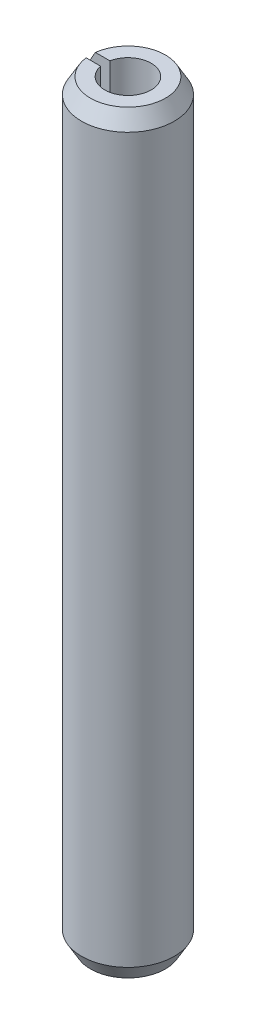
ISO-10303-21;
HEADER;
FILE_DESCRIPTION(('STEP AP214'),'2;1');
FILE_NAME('part.step','',(''),(''),'','','');
FILE_SCHEMA(('AUTOMOTIVE_DESIGN { 1 0 10303 214 1 1 1 1 }'));
ENDSEC;
DATA;
#1=APPLICATION_CONTEXT('core data for automotive mechanical design processes');
#2=APPLICATION_PROTOCOL_DEFINITION('international standard','automotive_design',2000,#1);
#3=PRODUCT_CONTEXT('',#1,'mechanical');
#4=PRODUCT('Part','Part','',(#3));
#5=PRODUCT_RELATED_PRODUCT_CATEGORY('part','',(#4));
#6=PRODUCT_DEFINITION_FORMATION('','',#4);
#7=PRODUCT_DEFINITION_CONTEXT('part definition',#1,'design');
#8=PRODUCT_DEFINITION('design','',#6,#7);
#9=PRODUCT_DEFINITION_SHAPE('','',#8);
#10=(LENGTH_UNIT() NAMED_UNIT(*) SI_UNIT(.MILLI.,.METRE.));
#11=(NAMED_UNIT(*) PLANE_ANGLE_UNIT() SI_UNIT($,.RADIAN.));
#12=(NAMED_UNIT(*) SI_UNIT($,.STERADIAN.) SOLID_ANGLE_UNIT());
#13=UNCERTAINTY_MEASURE_WITH_UNIT(LENGTH_MEASURE(1.E-05),#10,'distance_accuracy_value','');
#14=(GEOMETRIC_REPRESENTATION_CONTEXT(3) GLOBAL_UNCERTAINTY_ASSIGNED_CONTEXT((#13)) GLOBAL_UNIT_ASSIGNED_CONTEXT((#10,
#11,#12)) REPRESENTATION_CONTEXT('',''));
#15=CARTESIAN_POINT('',(0.,0.,0.));
#16=DIRECTION('',(0.,0.,1.));
#17=DIRECTION('',(1.,0.,0.));
#18=AXIS2_PLACEMENT_3D('',#15,#16,#17);
#19=CARTESIAN_POINT('',(2.,32.5,0.));
#20=DIRECTION('',(0.,-1.,0.));
#21=DIRECTION('',(0.,0.,-1.));
#22=AXIS2_PLACEMENT_3D('',#19,#20,#21);
#23=PLANE('',#22);
#24=CARTESIAN_POINT('',(0.,32.5,0.));
#25=DIRECTION('',(0.,-1.,0.));
#26=DIRECTION('',(0.,0.,-1.));
#27=AXIS2_PLACEMENT_3D('',#24,#25,#26);
#28=CIRCLE('',#27,3.23019964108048);
#29=CARTESIAN_POINT('',(-3.20533769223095,32.5,0.4));
#30=VERTEX_POINT('',#29);
#31=CARTESIAN_POINT('',(-3.20533769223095,32.5,-0.4));
#32=VERTEX_POINT('',#31);
#33=EDGE_CURVE('E102',#30,#32,#28,.F.);
#34=ORIENTED_EDGE('',*,*,#33,.T.);
#35=DIRECTION('',(-1.,0.,0.));
#36=VECTOR('',#35,1.);
#37=CARTESIAN_POINT('',(0.,32.5,-0.4));
#38=LINE('',#37,#36);
#39=CARTESIAN_POINT('',(-1.95959179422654,32.5,-0.4));
#40=VERTEX_POINT('',#39);
#41=EDGE_CURVE('E50',#40,#32,#38,.T.);
#42=ORIENTED_EDGE('',*,*,#41,.F.);
#43=CARTESIAN_POINT('',(0.,32.5,0.));
#44=DIRECTION('',(0.,1.,0.));
#45=DIRECTION('',(0.,0.,1.));
#46=AXIS2_PLACEMENT_3D('',#43,#44,#45);
#47=CIRCLE('',#46,2.);
#48=CARTESIAN_POINT('',(-1.95959179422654,32.5,0.4));
#49=VERTEX_POINT('',#48);
#50=EDGE_CURVE('E94',#49,#40,#47,.T.);
#51=ORIENTED_EDGE('',*,*,#50,.F.);
#52=DIRECTION('',(1.,0.,0.));
#53=VECTOR('',#52,1.);
#54=CARTESIAN_POINT('',(0.,32.5,0.4));
#55=LINE('',#54,#53);
#56=EDGE_CURVE('E103',#30,#49,#55,.T.);
#57=ORIENTED_EDGE('',*,*,#56,.F.);
#58=EDGE_LOOP('',(#34,#42,#51,#57));
#59=FACE_BOUND('',#58,.T.);
#60=ADVANCED_FACE('F31',(#59),#23,.F.);
#61=CARTESIAN_POINT('',(0.,32.5,0.));
#62=DIRECTION('',(0.,1.,0.));
#63=DIRECTION('',(0.,0.,1.));
#64=AXIS2_PLACEMENT_3D('',#61,#62,#63);
#65=CYLINDRICAL_SURFACE('',#64,4.);
#66=CARTESIAN_POINT('',(0.,-31.1666666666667,0.));
#67=DIRECTION('',(0.,1.,0.));
#68=DIRECTION('',(0.,0.,1.));
#69=AXIS2_PLACEMENT_3D('',#66,#67,#68);
#70=CIRCLE('',#69,4.);
#71=CARTESIAN_POINT('',(-3.97994974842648,-31.1666666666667,0.4));
#72=VERTEX_POINT('',#71);
#73=CARTESIAN_POINT('',(-3.97994974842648,-31.1666666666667,-0.4));
#74=VERTEX_POINT('',#73);
#75=EDGE_CURVE('E116',#72,#74,#70,.T.);
#76=ORIENTED_EDGE('',*,*,#75,.T.);
#77=DIRECTION('',(0.,1.,0.));
#78=VECTOR('',#77,1.);
#79=CARTESIAN_POINT('',(-3.97994974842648,32.5,-0.4));
#80=LINE('',#79,#78);
#81=CARTESIAN_POINT('',(-3.97994974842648,31.1666666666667,-0.4));
#82=VERTEX_POINT('',#81);
#83=EDGE_CURVE('E151',#74,#82,#80,.T.);
#84=ORIENTED_EDGE('',*,*,#83,.T.);
#85=CARTESIAN_POINT('',(0.,31.1666666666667,0.));
#86=DIRECTION('',(0.,-1.,0.));
#87=DIRECTION('',(0.,0.,-1.));
#88=AXIS2_PLACEMENT_3D('',#85,#86,#87);
#89=CIRCLE('',#88,4.);
#90=CARTESIAN_POINT('',(-3.97994974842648,31.1666666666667,0.4));
#91=VERTEX_POINT('',#90);
#92=EDGE_CURVE('E110',#82,#91,#89,.T.);
#93=ORIENTED_EDGE('',*,*,#92,.T.);
#94=DIRECTION('',(0.,1.,0.));
#95=VECTOR('',#94,1.);
#96=CARTESIAN_POINT('',(-3.97994974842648,32.5,0.4));
#97=LINE('',#96,#95);
#98=EDGE_CURVE('E58',#91,#72,#97,.F.);
#99=ORIENTED_EDGE('',*,*,#98,.T.);
#100=EDGE_LOOP('',(#76,#84,#93,#99));
#101=FACE_BOUND('',#100,.T.);
#102=ADVANCED_FACE('F155',(#101),#65,.T.);
#103=CARTESIAN_POINT('',(4.00000000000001,-32.5,0.));
#104=DIRECTION('',(0.,1.,0.));
#105=DIRECTION('',(0.,0.,1.));
#106=AXIS2_PLACEMENT_3D('',#103,#104,#105);
#107=PLANE('',#106);
#108=CARTESIAN_POINT('',(0.,-32.5,0.));
#109=DIRECTION('',(0.,1.,0.));
#110=DIRECTION('',(0.,0.,1.));
#111=AXIS2_PLACEMENT_3D('',#108,#109,#110);
#112=CIRCLE('',#111,2.);
#113=CARTESIAN_POINT('',(-1.95959179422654,-32.5,0.4));
#114=VERTEX_POINT('',#113);
#115=CARTESIAN_POINT('',(-1.95959179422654,-32.5,-0.4));
#116=VERTEX_POINT('',#115);
#117=EDGE_CURVE('E108',#114,#116,#112,.T.);
#118=ORIENTED_EDGE('',*,*,#117,.T.);
#119=DIRECTION('',(-1.,0.,0.));
#120=VECTOR('',#119,1.);
#121=CARTESIAN_POINT('',(0.,-32.5,-0.4));
#122=LINE('',#121,#120);
#123=CARTESIAN_POINT('',(-3.20533769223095,-32.5,-0.4));
#124=VERTEX_POINT('',#123);
#125=EDGE_CURVE('E89',#116,#124,#122,.T.);
#126=ORIENTED_EDGE('',*,*,#125,.T.);
#127=CARTESIAN_POINT('',(0.,-32.5,0.));
#128=DIRECTION('',(0.,1.,0.));
#129=DIRECTION('',(0.,0.,1.));
#130=AXIS2_PLACEMENT_3D('',#127,#128,#129);
#131=CIRCLE('',#130,3.23019964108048);
#132=CARTESIAN_POINT('',(-3.20533769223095,-32.5,0.4));
#133=VERTEX_POINT('',#132);
#134=EDGE_CURVE('E119',#124,#133,#131,.F.);
#135=ORIENTED_EDGE('',*,*,#134,.T.);
#136=DIRECTION('',(1.,0.,0.));
#137=VECTOR('',#136,1.);
#138=CARTESIAN_POINT('',(0.,-32.5,0.4));
#139=LINE('',#138,#137);
#140=EDGE_CURVE('E160',#133,#114,#139,.T.);
#141=ORIENTED_EDGE('',*,*,#140,.T.);
#142=EDGE_LOOP('',(#118,#126,#135,#141));
#143=FACE_BOUND('',#142,.T.);
#144=ADVANCED_FACE('F166',(#143),#107,.F.);
#145=CARTESIAN_POINT('',(0.,32.5,0.));
#146=DIRECTION('',(0.,1.,0.));
#147=DIRECTION('',(0.,0.,1.));
#148=AXIS2_PLACEMENT_3D('',#145,#146,#147);
#149=CYLINDRICAL_SURFACE('',#148,2.);
#150=ORIENTED_EDGE('',*,*,#50,.T.);
#151=DIRECTION('',(0.,1.,0.));
#152=VECTOR('',#151,1.);
#153=CARTESIAN_POINT('',(-1.95959179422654,32.5,-0.4));
#154=LINE('',#153,#152);
#155=EDGE_CURVE('E86',#40,#116,#154,.F.);
#156=ORIENTED_EDGE('',*,*,#155,.T.);
#157=ORIENTED_EDGE('',*,*,#117,.F.);
#158=DIRECTION('',(0.,1.,0.));
#159=VECTOR('',#158,1.);
#160=CARTESIAN_POINT('',(-1.95959179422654,32.5,0.4));
#161=LINE('',#160,#159);
#162=EDGE_CURVE('E107',#114,#49,#161,.T.);
#163=ORIENTED_EDGE('',*,*,#162,.T.);
#164=EDGE_LOOP('',(#150,#156,#157,#163));
#165=FACE_BOUND('',#164,.T.);
#166=ADVANCED_FACE('F106',(#165),#149,.F.);
#167=CARTESIAN_POINT('',(0.,-31.1666666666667,0.));
#168=DIRECTION('',(0.,1.,0.));
#169=DIRECTION('',(0.,0.,1.));
#170=AXIS2_PLACEMENT_3D('',#167,#168,#169);
#171=CONICAL_SURFACE('',#170,4.,0.523598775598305);
#172=CARTESIAN_POINT('',(-5.97070394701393,-27.7301259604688,-0.4));
#173=CARTESIAN_POINT('',(-5.77082052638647,-28.075554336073,-0.4));
#174=CARTESIAN_POINT('',(-5.57090805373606,-28.4209659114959,-0.4));
#175=CARTESIAN_POINT('',(-5.1709901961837,-29.1117340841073,-0.4));
#176=CARTESIAN_POINT('',(-4.9709848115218,-29.4570906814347,-0.4));
#177=CARTESIAN_POINT('',(-4.57084755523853,-30.1477253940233,-0.4));
#178=CARTESIAN_POINT('',(-4.37071568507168,-30.493003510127,-0.4));
#179=CARTESIAN_POINT('',(-3.970257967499,-31.1834484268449,-0.4));
#180=CARTESIAN_POINT('',(-3.76993211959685,-31.5286152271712,-0.4));
#181=CARTESIAN_POINT('',(-3.36897378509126,-32.2187802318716,-0.4));
#182=CARTESIAN_POINT('',(-3.16834129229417,-32.5637784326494,-0.4));
#183=CARTESIAN_POINT('',(-2.8669955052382,-33.0810428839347,-0.4));
#184=CARTESIAN_POINT('',(-2.76648107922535,-33.2534249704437,-0.4));
#185=CARTESIAN_POINT('',(-2.5652667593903,-33.5980813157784,-0.4));
#186=CARTESIAN_POINT('',(-2.46456686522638,-33.7703555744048,-0.4));
#187=CARTESIAN_POINT('',(-2.26290181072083,-34.1147541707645,-0.4));
#188=CARTESIAN_POINT('',(-2.16193664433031,-34.2868785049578,-0.4));
#189=CARTESIAN_POINT('',(-1.95961247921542,-34.6308944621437,-0.4));
#190=CARTESIAN_POINT('',(-1.85825348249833,-34.8027860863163,-0.4));
#191=CARTESIAN_POINT('',(-1.65490956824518,-35.1462050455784,-0.4));
#192=CARTESIAN_POINT('',(-1.55292463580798,-35.3177323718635,-0.4));
#193=CARTESIAN_POINT('',(-1.39912493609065,-35.5745334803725,-0.4));
#194=CARTESIAN_POINT('',(-1.34772087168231,-35.660052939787,-0.4));
#195=CARTESIAN_POINT('',(-1.24451429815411,-35.8308519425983,-0.4));
#196=CARTESIAN_POINT('',(-1.19271178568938,-35.9161314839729,-0.4));
#197=CARTESIAN_POINT('',(-1.1406481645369,-36.0012522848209,-0.4));
#198=B_SPLINE_CURVE_WITH_KNOTS('',3,(#172,#173,#174,#175,#176,#177,#178,#179,#180,#181,#182,
#183,#184,#185,#186,#187,#188,#189,#190,#191,#192,#193,#194,#195,#196,#197),.UNSPECIFIED.,.F.,
.F.,(4,2,2,2,2,2,2,2,2,2,2,2,4),(0.,1.19727495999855,2.39454684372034,3.59180520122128,
4.78906663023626,5.98635256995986,6.58499144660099,7.18363142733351,7.78228517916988,
8.38093588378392,8.97960089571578,9.27893857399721,9.57827876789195),.UNSPECIFIED.);
#199=EDGE_CURVE('E95',#74,#124,#198,.T.);
#200=ORIENTED_EDGE('',*,*,#199,.F.);
#201=ORIENTED_EDGE('',*,*,#75,.F.);
#202=CARTESIAN_POINT('',(-1.1406481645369,-36.0012522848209,0.4));
#203=CARTESIAN_POINT('',(-1.21071491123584,-35.8866570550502,0.4));
#204=CARTESIAN_POINT('',(-1.2803354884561,-35.7717912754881,0.4));
#205=CARTESIAN_POINT('',(-1.41892863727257,-35.5416712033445,0.4));
#206=CARTESIAN_POINT('',(-1.48790121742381,-35.4264169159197,0.4));
#207=CARTESIAN_POINT('',(-1.62544297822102,-35.1956720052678,0.4));
#208=CARTESIAN_POINT('',(-1.69401216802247,-35.0801813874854,0.4));
#209=CARTESIAN_POINT('',(-1.83086264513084,-34.849029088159,0.4));
#210=CARTESIAN_POINT('',(-1.89914393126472,-34.7333674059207,0.4));
#211=CARTESIAN_POINT('',(-2.10173269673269,-34.3895131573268,0.4));
#212=CARTESIAN_POINT('',(-2.23574693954,-34.1611479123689,0.4));
#213=CARTESIAN_POINT('',(-2.50332143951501,-33.7041515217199,0.4));
#214=CARTESIAN_POINT('',(-2.63688169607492,-33.4755203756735,0.4));
#215=CARTESIAN_POINT('',(-3.03714675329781,-32.7893713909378,0.4));
#216=CARTESIAN_POINT('',(-3.30343011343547,-32.3316077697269,0.4));
#217=CARTESIAN_POINT('',(-3.76993481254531,-31.5286045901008,0.4));
#218=CARTESIAN_POINT('',(-3.97026782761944,-31.1834298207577,0.4));
#219=CARTESIAN_POINT('',(-4.3707380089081,-30.4929666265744,0.4));
#220=CARTESIAN_POINT('',(-4.57087517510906,-30.1476782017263,0.4));
#221=CARTESIAN_POINT('',(-4.97101256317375,-29.4570423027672,0.4));
#222=CARTESIAN_POINT('',(-5.17101279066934,-29.1116948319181,0.4));
#223=CARTESIAN_POINT('',(-5.57091977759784,-28.4209458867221,0.4));
#224=CARTESIAN_POINT('',(-5.77082653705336,-28.0755444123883,0.4));
#225=CARTESIAN_POINT('',(-5.97070394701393,-27.7301259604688,0.4));
#226=B_SPLINE_CURVE_WITH_KNOTS('',3,(#202,#203,#204,#205,#206,#207,#208,#209,#210,#211,#212,
#213,#214,#215,#216,#217,#218,#219,#220,#221,#222,#223,#224,#225),.UNSPECIFIED.,.F.,.F.,(4,2,2,
2,2,2,2,2,2,2,2,4),(0.,0.402951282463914,0.805897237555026,1.20883401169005,1.61177242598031,
2.40612299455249,3.2004746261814,4.78921185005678,5.98650482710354,7.18379788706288,
8.3810383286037,9.5782784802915),.UNSPECIFIED.);
#227=EDGE_CURVE('E133',#133,#72,#226,.T.);
#228=ORIENTED_EDGE('',*,*,#227,.F.);
#229=ORIENTED_EDGE('',*,*,#134,.F.);
#230=EDGE_LOOP('',(#200,#201,#228,#229));
#231=FACE_BOUND('',#230,.T.);
#232=ADVANCED_FACE('F141',(#231),#171,.T.);
#233=CARTESIAN_POINT('',(0.,32.5,0.));
#234=DIRECTION('',(0.,-1.,0.));
#235=DIRECTION('',(0.,0.,-1.));
#236=AXIS2_PLACEMENT_3D('',#233,#234,#235);
#237=CONICAL_SURFACE('',#236,3.23019964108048,0.523598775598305);
#238=CARTESIAN_POINT('',(-1.1406481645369,36.0012522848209,-0.4));
#239=CARTESIAN_POINT('',(-1.21071491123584,35.8866570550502,-0.4));
#240=CARTESIAN_POINT('',(-1.2803354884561,35.7717912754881,-0.4));
#241=CARTESIAN_POINT('',(-1.41892863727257,35.5416712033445,-0.4));
#242=CARTESIAN_POINT('',(-1.48790121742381,35.4264169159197,-0.4));
#243=CARTESIAN_POINT('',(-1.62544297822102,35.1956720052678,-0.4));
#244=CARTESIAN_POINT('',(-1.69401216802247,35.0801813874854,-0.4));
#245=CARTESIAN_POINT('',(-1.83086264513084,34.849029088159,-0.4));
#246=CARTESIAN_POINT('',(-1.89914393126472,34.7333674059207,-0.4));
#247=CARTESIAN_POINT('',(-2.10173269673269,34.3895131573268,-0.4));
#248=CARTESIAN_POINT('',(-2.23574693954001,34.1611479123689,-0.4));
#249=CARTESIAN_POINT('',(-2.50332143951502,33.7041515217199,-0.4));
#250=CARTESIAN_POINT('',(-2.63688169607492,33.4755203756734,-0.4));
#251=CARTESIAN_POINT('',(-3.03714675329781,32.7893713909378,-0.4));
#252=CARTESIAN_POINT('',(-3.30343011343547,32.3316077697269,-0.4));
#253=CARTESIAN_POINT('',(-3.76993481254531,31.5286045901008,-0.4));
#254=CARTESIAN_POINT('',(-3.97026782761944,31.1834298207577,-0.4));
#255=CARTESIAN_POINT('',(-4.3707380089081,30.4929666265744,-0.4));
#256=CARTESIAN_POINT('',(-4.57087517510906,30.1476782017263,-0.4));
#257=CARTESIAN_POINT('',(-4.97101256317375,29.4570423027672,-0.4));
#258=CARTESIAN_POINT('',(-5.17101279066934,29.1116948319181,-0.4));
#259=CARTESIAN_POINT('',(-5.57091977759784,28.4209458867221,-0.4));
#260=CARTESIAN_POINT('',(-5.77082653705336,28.0755444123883,-0.4));
#261=CARTESIAN_POINT('',(-5.97070394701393,27.7301259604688,-0.4));
#262=B_SPLINE_CURVE_WITH_KNOTS('',3,(#238,#239,#240,#241,#242,#243,#244,#245,#246,#247,#248,
#249,#250,#251,#252,#253,#254,#255,#256,#257,#258,#259,#260,#261),.UNSPECIFIED.,.F.,.F.,(4,2,2,
2,2,2,2,2,2,2,2,4),(0.,0.402951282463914,0.805897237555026,1.20883401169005,1.61177242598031,
2.40612299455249,3.20047462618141,4.78921185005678,5.98650482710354,7.18379788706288,
8.3810383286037,9.5782784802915),.UNSPECIFIED.);
#263=EDGE_CURVE('E11',#32,#82,#262,.T.);
#264=ORIENTED_EDGE('',*,*,#263,.F.);
#265=ORIENTED_EDGE('',*,*,#33,.F.);
#266=CARTESIAN_POINT('',(-5.97070394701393,27.7301259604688,0.4));
#267=CARTESIAN_POINT('',(-5.77082052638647,28.075554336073,0.4));
#268=CARTESIAN_POINT('',(-5.57090805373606,28.4209659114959,0.4));
#269=CARTESIAN_POINT('',(-5.1709901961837,29.1117340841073,0.4));
#270=CARTESIAN_POINT('',(-4.9709848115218,29.4570906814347,0.4));
#271=CARTESIAN_POINT('',(-4.57084755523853,30.1477253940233,0.4));
#272=CARTESIAN_POINT('',(-4.37071568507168,30.493003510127,0.4));
#273=CARTESIAN_POINT('',(-3.970257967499,31.1834484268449,0.4));
#274=CARTESIAN_POINT('',(-3.76993211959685,31.5286152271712,0.4));
#275=CARTESIAN_POINT('',(-3.36897378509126,32.2187802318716,0.4));
#276=CARTESIAN_POINT('',(-3.16834129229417,32.5637784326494,0.4));
#277=CARTESIAN_POINT('',(-2.8669955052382,33.0810428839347,0.4));
#278=CARTESIAN_POINT('',(-2.76648107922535,33.2534249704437,0.4));
#279=CARTESIAN_POINT('',(-2.5652667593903,33.5980813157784,0.4));
#280=CARTESIAN_POINT('',(-2.46456686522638,33.7703555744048,0.4));
#281=CARTESIAN_POINT('',(-2.26290181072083,34.1147541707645,0.4));
#282=CARTESIAN_POINT('',(-2.16193664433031,34.2868785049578,0.4));
#283=CARTESIAN_POINT('',(-1.95961247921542,34.6308944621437,0.4));
#284=CARTESIAN_POINT('',(-1.85825348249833,34.8027860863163,0.4));
#285=CARTESIAN_POINT('',(-1.65490956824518,35.1462050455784,0.4));
#286=CARTESIAN_POINT('',(-1.55292463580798,35.3177323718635,0.4));
#287=CARTESIAN_POINT('',(-1.39912493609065,35.5745334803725,0.4));
#288=CARTESIAN_POINT('',(-1.34772087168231,35.660052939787,0.4));
#289=CARTESIAN_POINT('',(-1.24451429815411,35.8308519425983,0.4));
#290=CARTESIAN_POINT('',(-1.19271178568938,35.9161314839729,0.4));
#291=CARTESIAN_POINT('',(-1.1406481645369,36.0012522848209,0.4));
#292=B_SPLINE_CURVE_WITH_KNOTS('',3,(#266,#267,#268,#269,#270,#271,#272,#273,#274,#275,#276,
#277,#278,#279,#280,#281,#282,#283,#284,#285,#286,#287,#288,#289,#290,#291),.UNSPECIFIED.,.F.,
.F.,(4,2,2,2,2,2,2,2,2,2,2,2,4),(0.,1.19727495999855,2.39454684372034,3.59180520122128,
4.78906663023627,5.98635256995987,6.58499144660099,7.18363142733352,7.78228517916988,
8.38093588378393,8.97960089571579,9.27893857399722,9.57827876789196),.UNSPECIFIED.);
#293=EDGE_CURVE('E44',#91,#30,#292,.T.);
#294=ORIENTED_EDGE('',*,*,#293,.F.);
#295=ORIENTED_EDGE('',*,*,#92,.F.);
#296=EDGE_LOOP('',(#264,#265,#294,#295));
#297=FACE_BOUND('',#296,.T.);
#298=ADVANCED_FACE('F33',(#297),#237,.T.);
#299=CARTESIAN_POINT('',(0.,-32.5,0.4));
#300=DIRECTION('',(0.,0.,1.));
#301=DIRECTION('',(1.,0.,0.));
#302=AXIS2_PLACEMENT_3D('',#299,#300,#301);
#303=PLANE('',#302);
#304=ORIENTED_EDGE('',*,*,#140,.F.);
#305=ORIENTED_EDGE('',*,*,#227,.T.);
#306=ORIENTED_EDGE('',*,*,#98,.F.);
#307=ORIENTED_EDGE('',*,*,#293,.T.);
#308=ORIENTED_EDGE('',*,*,#56,.T.);
#309=ORIENTED_EDGE('',*,*,#162,.F.);
#310=EDGE_LOOP('',(#304,#305,#306,#307,#308,#309));
#311=FACE_BOUND('',#310,.T.);
#312=ADVANCED_FACE('F126',(#311),#303,.F.);
#313=CARTESIAN_POINT('',(0.,-32.5,-0.4));
#314=DIRECTION('',(0.,0.,-1.));
#315=DIRECTION('',(-1.,0.,0.));
#316=AXIS2_PLACEMENT_3D('',#313,#314,#315);
#317=PLANE('',#316);
#318=ORIENTED_EDGE('',*,*,#41,.T.);
#319=ORIENTED_EDGE('',*,*,#263,.T.);
#320=ORIENTED_EDGE('',*,*,#83,.F.);
#321=ORIENTED_EDGE('',*,*,#199,.T.);
#322=ORIENTED_EDGE('',*,*,#125,.F.);
#323=ORIENTED_EDGE('',*,*,#155,.F.);
#324=EDGE_LOOP('',(#318,#319,#320,#321,#322,#323));
#325=FACE_BOUND('',#324,.T.);
#326=ADVANCED_FACE('F87',(#325),#317,.F.);
#327=CLOSED_SHELL('',(#60,#102,#144,#166,#232,#298,#312,#326));
#328=MANIFOLD_SOLID_BREP('B2',#327);
#329=ADVANCED_BREP_SHAPE_REPRESENTATION('',(#18,#328),#14);
#330=SHAPE_DEFINITION_REPRESENTATION(#9,#329);
ENDSEC;
END-ISO-10303-21;
